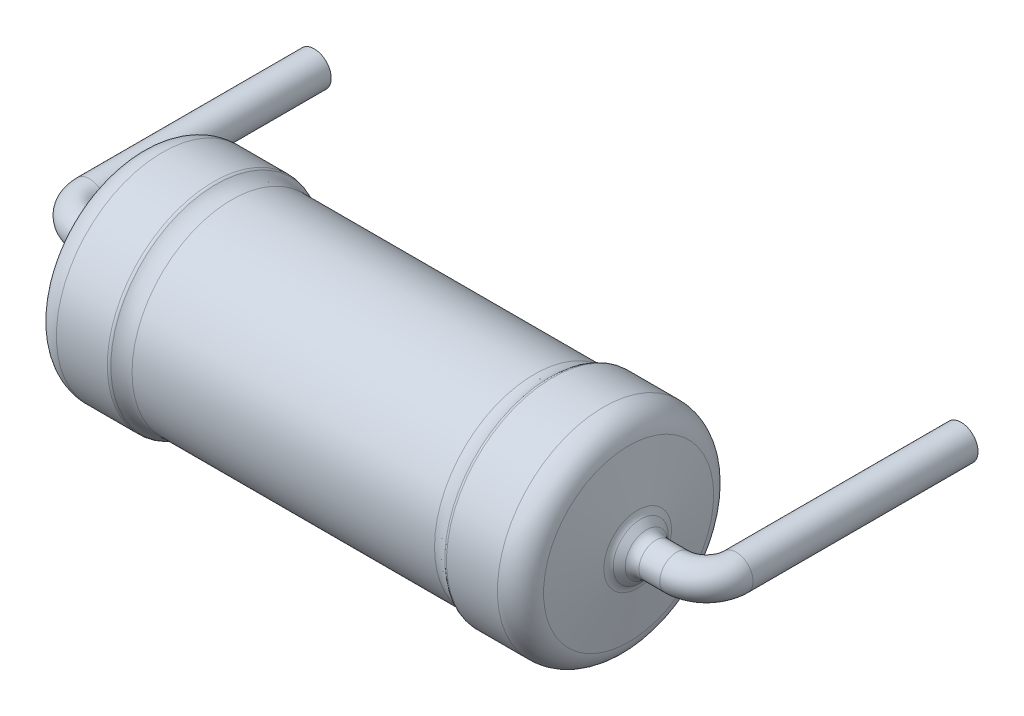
ISO-10303-21;
HEADER;
FILE_DESCRIPTION(('STEP AP214'),'2;1');
FILE_NAME('part.step','',(''),(''),'','','');
FILE_SCHEMA(('AUTOMOTIVE_DESIGN { 1 0 10303 214 1 1 1 1 }'));
ENDSEC;
DATA;
#1=APPLICATION_CONTEXT('core data for automotive mechanical design processes');
#2=APPLICATION_PROTOCOL_DEFINITION('international standard','automotive_design',2000,#1);
#3=PRODUCT_CONTEXT('',#1,'mechanical');
#4=PRODUCT('Part','Part','',(#3));
#5=PRODUCT_RELATED_PRODUCT_CATEGORY('part','',(#4));
#6=PRODUCT_DEFINITION_FORMATION('','',#4);
#7=PRODUCT_DEFINITION_CONTEXT('part definition',#1,'design');
#8=PRODUCT_DEFINITION('design','',#6,#7);
#9=PRODUCT_DEFINITION_SHAPE('','',#8);
#10=(LENGTH_UNIT() NAMED_UNIT(*) SI_UNIT(.MILLI.,.METRE.));
#11=(NAMED_UNIT(*) PLANE_ANGLE_UNIT() SI_UNIT($,.RADIAN.));
#12=(NAMED_UNIT(*) SI_UNIT($,.STERADIAN.) SOLID_ANGLE_UNIT());
#13=UNCERTAINTY_MEASURE_WITH_UNIT(LENGTH_MEASURE(1.E-05),#10,'distance_accuracy_value','');
#14=(GEOMETRIC_REPRESENTATION_CONTEXT(3) GLOBAL_UNCERTAINTY_ASSIGNED_CONTEXT((#13)) GLOBAL_UNIT_ASSIGNED_CONTEXT((#10,
#11,#12)) REPRESENTATION_CONTEXT('',''));
#15=CARTESIAN_POINT('',(0.,0.,0.));
#16=DIRECTION('',(0.,0.,1.));
#17=DIRECTION('',(1.,0.,0.));
#18=AXIS2_PLACEMENT_3D('',#15,#16,#17);
#19=CARTESIAN_POINT('',(1.1907315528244,0.,0.));
#20=DIRECTION('',(-1.,0.,0.));
#21=DIRECTION('',(0.,0.,1.));
#22=AXIS2_PLACEMENT_3D('',#19,#20,#21);
#23=PLANE('',#22);
#24=CARTESIAN_POINT('',(1.1907315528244,0.,3.5));
#25=DIRECTION('',(-1.,0.,0.));
#26=DIRECTION('',(0.,0.,1.));
#27=AXIS2_PLACEMENT_3D('',#24,#25,#26);
#28=CIRCLE('',#27,0.400000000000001);
#29=CARTESIAN_POINT('',(1.1907315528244,0.,3.9));
#30=VERTEX_POINT('',#29);
#31=EDGE_CURVE('P0_E18',#30,#30,#28,.T.);
#32=ORIENTED_EDGE('',*,*,#31,.F.);
#33=EDGE_LOOP('',(#32));
#34=FACE_BOUND('',#33,.T.);
#35=ADVANCED_FACE('P0_F15',(#34),#23,.F.);
#36=CARTESIAN_POINT('',(1.1907315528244,0.,3.5));
#37=DIRECTION('',(-1.,0.,0.));
#38=DIRECTION('',(0.,0.,1.));
#39=AXIS2_PLACEMENT_3D('',#36,#37,#38);
#40=CYLINDRICAL_SURFACE('',#39,0.400000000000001);
#41=CARTESIAN_POINT('',(0.700000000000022,0.,3.5));
#42=DIRECTION('',(-1.,0.,0.));
#43=DIRECTION('',(0.,0.,1.));
#44=AXIS2_PLACEMENT_3D('',#41,#42,#43);
#45=CIRCLE('',#44,0.400000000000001);
#46=CARTESIAN_POINT('',(0.700000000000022,0.,3.9));
#47=VERTEX_POINT('',#46);
#48=EDGE_CURVE('P0_E26',#47,#47,#45,.T.);
#49=ORIENTED_EDGE('',*,*,#48,.F.);
#50=EDGE_LOOP('',(#49));
#51=FACE_BOUND('',#50,.T.);
#52=ORIENTED_EDGE('',*,*,#31,.T.);
#53=EDGE_LOOP('',(#52));
#54=FACE_BOUND('',#53,.T.);
#55=ADVANCED_FACE('P0_F41',(#51,#54),#40,.T.);
#56=CARTESIAN_POINT('',(0.700000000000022,0.,2.79999999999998));
#57=DIRECTION('',(0.,-1.,0.));
#58=DIRECTION('',(0.,0.,1.));
#59=AXIS2_PLACEMENT_3D('',#56,#57,#58);
#60=TOROIDAL_SURFACE('',#59,0.700000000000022,0.400000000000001);
#61=CARTESIAN_POINT('',(0.,0.,2.79999999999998));
#62=DIRECTION('',(0.,0.,-1.));
#63=DIRECTION('',(-1.,0.,0.));
#64=AXIS2_PLACEMENT_3D('',#61,#62,#63);
#65=CIRCLE('',#64,0.400000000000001);
#66=CARTESIAN_POINT('',(-0.400000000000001,0.,2.79999999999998));
#67=VERTEX_POINT('',#66);
#68=EDGE_CURVE('P0_E22',#67,#67,#65,.T.);
#69=ORIENTED_EDGE('',*,*,#68,.F.);
#70=EDGE_LOOP('',(#69));
#71=FACE_BOUND('',#70,.T.);
#72=ORIENTED_EDGE('',*,*,#48,.T.);
#73=EDGE_LOOP('',(#72));
#74=FACE_BOUND('',#73,.T.);
#75=ADVANCED_FACE('P0_F37',(#71,#74),#60,.T.);
#76=CARTESIAN_POINT('',(3.5,0.,-2.5));
#77=DIRECTION('',(0.,0.,-1.));
#78=DIRECTION('',(-1.,0.,0.));
#79=AXIS2_PLACEMENT_3D('',#76,#77,#78);
#80=PLANE('',#79);
#81=CARTESIAN_POINT('',(0.,0.,-2.5));
#82=DIRECTION('',(0.,0.,-1.));
#83=DIRECTION('',(-1.,0.,0.));
#84=AXIS2_PLACEMENT_3D('',#81,#82,#83);
#85=CIRCLE('',#84,0.400000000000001);
#86=CARTESIAN_POINT('',(-0.400000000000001,0.,-2.5));
#87=VERTEX_POINT('',#86);
#88=EDGE_CURVE('P0_E10',#87,#87,#85,.F.);
#89=ORIENTED_EDGE('',*,*,#88,.F.);
#90=EDGE_LOOP('',(#89));
#91=FACE_BOUND('',#90,.T.);
#92=ADVANCED_FACE('P0_F40',(#91),#80,.T.);
#93=CARTESIAN_POINT('',(0.,0.,2.79999999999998));
#94=DIRECTION('',(0.,0.,-1.));
#95=DIRECTION('',(-1.,0.,0.));
#96=AXIS2_PLACEMENT_3D('',#93,#94,#95);
#97=CYLINDRICAL_SURFACE('',#96,0.400000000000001);
#98=ORIENTED_EDGE('',*,*,#88,.T.);
#99=EDGE_LOOP('',(#98));
#100=FACE_BOUND('',#99,.T.);
#101=ORIENTED_EDGE('',*,*,#68,.T.);
#102=EDGE_LOOP('',(#101));
#103=FACE_BOUND('',#102,.T.);
#104=ADVANCED_FACE('P0_F53',(#100,#103),#97,.T.);
#105=CLOSED_SHELL('',(#35,#55,#75,#92,#104));
#106=MANIFOLD_SOLID_BREP('P0_B1',#105);
#107=CARTESIAN_POINT('',(14.0492684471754,0.,0.));
#108=DIRECTION('',(1.,0.,0.));
#109=DIRECTION('',(0.,0.,-1.));
#110=AXIS2_PLACEMENT_3D('',#107,#108,#109);
#111=PLANE('',#110);
#112=CARTESIAN_POINT('',(14.0492684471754,0.,3.5));
#113=DIRECTION('',(1.,0.,0.));
#114=DIRECTION('',(0.,0.,-1.));
#115=AXIS2_PLACEMENT_3D('',#112,#113,#114);
#116=CIRCLE('',#115,0.4);
#117=CARTESIAN_POINT('',(14.0492684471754,0.,3.1));
#118=VERTEX_POINT('',#117);
#119=EDGE_CURVE('P1_E18',#118,#118,#116,.T.);
#120=ORIENTED_EDGE('',*,*,#119,.F.);
#121=EDGE_LOOP('',(#120));
#122=FACE_BOUND('',#121,.T.);
#123=ADVANCED_FACE('P1_F15',(#122),#111,.F.);
#124=CARTESIAN_POINT('',(14.0492684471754,0.,3.5));
#125=DIRECTION('',(1.,0.,0.));
#126=DIRECTION('',(0.,0.,-1.));
#127=AXIS2_PLACEMENT_3D('',#124,#125,#126);
#128=CYLINDRICAL_SURFACE('',#127,0.4);
#129=ORIENTED_EDGE('',*,*,#119,.T.);
#130=EDGE_LOOP('',(#129));
#131=FACE_BOUND('',#130,.T.);
#132=CARTESIAN_POINT('',(14.5399999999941,0.,3.5));
#133=DIRECTION('',(1.,0.,0.));
#134=DIRECTION('',(0.,0.,1.));
#135=AXIS2_PLACEMENT_3D('',#132,#133,#134);
#136=CIRCLE('',#135,0.4);
#137=CARTESIAN_POINT('',(14.5399999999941,0.,3.9));
#138=VERTEX_POINT('',#137);
#139=EDGE_CURVE('P1_E26',#138,#138,#136,.T.);
#140=ORIENTED_EDGE('',*,*,#139,.F.);
#141=EDGE_LOOP('',(#140));
#142=FACE_BOUND('',#141,.T.);
#143=ADVANCED_FACE('P1_F41',(#131,#142),#128,.T.);
#144=CARTESIAN_POINT('',(14.5399999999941,0.,2.80000000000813));
#145=DIRECTION('',(0.,1.,0.));
#146=DIRECTION('',(0.,0.,1.));
#147=AXIS2_PLACEMENT_3D('',#144,#145,#146);
#148=TOROIDAL_SURFACE('',#147,0.699999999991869,0.4);
#149=ORIENTED_EDGE('',*,*,#139,.T.);
#150=EDGE_LOOP('',(#149));
#151=FACE_BOUND('',#150,.T.);
#152=CARTESIAN_POINT('',(15.239999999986,0.,2.80000000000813));
#153=DIRECTION('',(8.45143661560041E-12,0.,-1.));
#154=DIRECTION('',(-1.,0.,-8.45143661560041E-12));
#155=AXIS2_PLACEMENT_3D('',#152,#153,#154);
#156=CIRCLE('',#155,0.4);
#157=CARTESIAN_POINT('',(14.839999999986,0.,2.80000000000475));
#158=VERTEX_POINT('',#157);
#159=EDGE_CURVE('P1_E22',#158,#158,#156,.T.);
#160=ORIENTED_EDGE('',*,*,#159,.F.);
#161=EDGE_LOOP('',(#160));
#162=FACE_BOUND('',#161,.T.);
#163=ADVANCED_FACE('P1_F37',(#151,#162),#148,.T.);
#164=CARTESIAN_POINT('',(11.7400000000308,0.,-2.49999999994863));
#165=DIRECTION('',(0.,0.,-1.));
#166=DIRECTION('',(-1.,0.,0.));
#167=AXIS2_PLACEMENT_3D('',#164,#165,#166);
#168=PLANE('',#167);
#169=CARTESIAN_POINT('',(15.2400000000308,0.,-2.49999999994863));
#170=DIRECTION('',(8.45143661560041E-12,0.,-1.));
#171=DIRECTION('',(-1.,0.,-8.45143661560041E-12));
#172=AXIS2_PLACEMENT_3D('',#169,#170,#171);
#173=CIRCLE('',#172,0.4);
#174=CARTESIAN_POINT('',(14.8400000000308,0.,-2.49999999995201));
#175=VERTEX_POINT('',#174);
#176=EDGE_CURVE('P1_E10',#175,#175,#173,.F.);
#177=ORIENTED_EDGE('',*,*,#176,.F.);
#178=EDGE_LOOP('',(#177));
#179=FACE_BOUND('',#178,.T.);
#180=ADVANCED_FACE('P1_F40',(#179),#168,.T.);
#181=CARTESIAN_POINT('',(15.239999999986,0.,2.80000000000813));
#182=DIRECTION('',(8.45143661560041E-12,0.,-1.));
#183=DIRECTION('',(-1.,0.,-8.45143661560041E-12));
#184=AXIS2_PLACEMENT_3D('',#181,#182,#183);
#185=CYLINDRICAL_SURFACE('',#184,0.4);
#186=ORIENTED_EDGE('',*,*,#176,.T.);
#187=EDGE_LOOP('',(#186));
#188=FACE_BOUND('',#187,.T.);
#189=ORIENTED_EDGE('',*,*,#159,.T.);
#190=EDGE_LOOP('',(#189));
#191=FACE_BOUND('',#190,.T.);
#192=ADVANCED_FACE('P1_F53',(#188,#191),#185,.T.);
#193=CLOSED_SHELL('',(#123,#143,#163,#180,#192));
#194=MANIFOLD_SOLID_BREP('P1_B1',#193);
#195=CARTESIAN_POINT('',(1.1907315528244,0.,3.5));
#196=DIRECTION('',(-1.,0.,0.));
#197=DIRECTION('',(0.,0.,1.));
#198=AXIS2_PLACEMENT_3D('',#195,#196,#197);
#199=PLANE('',#198);
#200=CARTESIAN_POINT('',(1.1907315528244,0.,3.5));
#201=DIRECTION('',(1.,0.,0.));
#202=DIRECTION('',(0.,0.,-1.));
#203=AXIS2_PLACEMENT_3D('',#200,#201,#202);
#204=CIRCLE('',#203,0.400000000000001);
#205=CARTESIAN_POINT('',(1.1907315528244,0.,3.1));
#206=VERTEX_POINT('',#205);
#207=EDGE_CURVE('P2_E17',#206,#206,#204,.F.);
#208=ORIENTED_EDGE('',*,*,#207,.T.);
#209=EDGE_LOOP('',(#208));
#210=FACE_BOUND('',#209,.T.);
#211=ADVANCED_FACE('P2_F14',(#210),#199,.T.);
#212=CARTESIAN_POINT('',(1.1907315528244,0.,3.5));
#213=DIRECTION('',(1.,0.,0.));
#214=DIRECTION('',(0.,0.,-1.));
#215=AXIS2_PLACEMENT_3D('',#212,#213,#214);
#216=TOROIDAL_SURFACE('',#215,0.700000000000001,0.3);
#217=ORIENTED_EDGE('',*,*,#207,.F.);
#218=EDGE_LOOP('',(#217));
#219=FACE_BOUND('',#218,.T.);
#220=CARTESIAN_POINT('',(1.41367500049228,0.,3.5));
#221=DIRECTION('',(1.,0.,0.));
#222=DIRECTION('',(0.,0.,-1.));
#223=AXIS2_PLACEMENT_3D('',#220,#221,#222);
#224=CIRCLE('',#223,0.499260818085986);
#225=CARTESIAN_POINT('',(1.41367500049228,0.,3.00073918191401));
#226=VERTEX_POINT('',#225);
#227=EDGE_CURVE('P2_E321',#226,#226,#224,.T.);
#228=ORIENTED_EDGE('',*,*,#227,.F.);
#229=EDGE_LOOP('',(#228));
#230=FACE_BOUND('',#229,.T.);
#231=ADVANCED_FACE('P2_F163',(#219,#230),#216,.F.);
#232=CARTESIAN_POINT('',(1.54750112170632,0.,3.5));
#233=DIRECTION('',(1.,0.,0.));
#234=DIRECTION('',(0.,0.,-1.));
#235=AXIS2_PLACEMENT_3D('',#232,#233,#234);
#236=CONICAL_SURFACE('',#235,0.647889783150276,0.837758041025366);
#237=ORIENTED_EDGE('',*,*,#227,.T.);
#238=EDGE_LOOP('',(#237));
#239=FACE_BOUND('',#238,.T.);
#240=CARTESIAN_POINT('',(1.54750112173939,0.,3.5));
#241=DIRECTION('',(1.,0.,0.));
#242=DIRECTION('',(0.,0.,-1.));
#243=AXIS2_PLACEMENT_3D('',#240,#241,#242);
#244=CIRCLE('',#243,0.647889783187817);
#245=CARTESIAN_POINT('',(1.54750112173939,0.,2.85211021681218));
#246=VERTEX_POINT('',#245);
#247=EDGE_CURVE('P2_E149',#246,#246,#244,.F.);
#248=ORIENTED_EDGE('',*,*,#247,.T.);
#249=EDGE_LOOP('',(#248));
#250=FACE_BOUND('',#249,.T.);
#251=ADVANCED_FACE('P2_F160',(#239,#250),#236,.T.);
#252=CARTESIAN_POINT('',(1.32455767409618,0.,3.5));
#253=DIRECTION('',(1.,0.,0.));
#254=DIRECTION('',(0.,0.,-1.));
#255=AXIS2_PLACEMENT_3D('',#252,#253,#254);
#256=TOROIDAL_SURFACE('',#255,0.848628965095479,0.3);
#257=ORIENTED_EDGE('',*,*,#247,.F.);
#258=EDGE_LOOP('',(#257));
#259=FACE_BOUND('',#258,.T.);
#260=CARTESIAN_POINT('',(1.62000000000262,0.,3.5));
#261=DIRECTION('',(1.,0.,0.));
#262=DIRECTION('',(0.,0.,-1.));
#263=AXIS2_PLACEMENT_3D('',#260,#261,#262);
#264=CIRCLE('',#263,0.796534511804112);
#265=CARTESIAN_POINT('',(1.62000000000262,0.,2.70346548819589));
#266=VERTEX_POINT('',#265);
#267=EDGE_CURVE('P2_E145',#266,#266,#264,.T.);
#268=ORIENTED_EDGE('',*,*,#267,.F.);
#269=EDGE_LOOP('',(#268));
#270=FACE_BOUND('',#269,.T.);
#271=ADVANCED_FACE('P2_F156',(#259,#270),#256,.F.);
#272=CARTESIAN_POINT('',(14.0492684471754,0.,3.5));
#273=DIRECTION('',(1.,0.,0.));
#274=DIRECTION('',(0.,0.,-1.));
#275=AXIS2_PLACEMENT_3D('',#272,#273,#274);
#276=PLANE('',#275);
#277=CARTESIAN_POINT('',(14.0492684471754,0.,3.5));
#278=DIRECTION('',(1.,0.,0.));
#279=DIRECTION('',(0.,0.,-1.));
#280=AXIS2_PLACEMENT_3D('',#277,#278,#279);
#281=CIRCLE('',#280,0.4);
#282=CARTESIAN_POINT('',(14.0492684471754,0.,3.1));
#283=VERTEX_POINT('',#282);
#284=EDGE_CURVE('P2_E148',#283,#283,#281,.T.);
#285=ORIENTED_EDGE('',*,*,#284,.T.);
#286=EDGE_LOOP('',(#285));
#287=FACE_BOUND('',#286,.T.);
#288=ADVANCED_FACE('P2_F159',(#287),#276,.T.);
#289=CARTESIAN_POINT('',(1.83294205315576,0.,3.5));
#290=DIRECTION('',(1.,0.,0.));
#291=DIRECTION('',(0.,0.,-1.));
#292=AXIS2_PLACEMENT_3D('',#289,#290,#291);
#293=CONICAL_SURFACE('',#292,2.00418890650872,1.39626340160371);
#294=ORIENTED_EDGE('',*,*,#267,.T.);
#295=EDGE_LOOP('',(#294));
#296=FACE_BOUND('',#295,.T.);
#297=CARTESIAN_POINT('',(1.83294205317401,0.,3.5));
#298=DIRECTION('',(1.,0.,0.));
#299=DIRECTION('',(0.,0.,-1.));
#300=AXIS2_PLACEMENT_3D('',#297,#298,#299);
#301=CIRCLE('',#300,2.00418890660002);
#302=CARTESIAN_POINT('',(1.83294205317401,0.,1.49581109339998));
#303=VERTEX_POINT('',#302);
#304=EDGE_CURVE('P2_E123',#303,#303,#301,.T.);
#305=ORIENTED_EDGE('',*,*,#304,.F.);
#306=EDGE_LOOP('',(#305));
#307=FACE_BOUND('',#306,.T.);
#308=ADVANCED_FACE('P2_F139',(#296,#307),#293,.T.);
#309=CARTESIAN_POINT('',(14.0492684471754,0.,3.5));
#310=DIRECTION('',(1.,0.,0.));
#311=DIRECTION('',(0.,0.,-1.));
#312=AXIS2_PLACEMENT_3D('',#309,#310,#311);
#313=TOROIDAL_SURFACE('',#312,0.7,0.3);
#314=CARTESIAN_POINT('',(13.8263249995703,0.,3.5));
#315=DIRECTION('',(-1.,0.,0.));
#316=DIRECTION('',(0.,0.,1.));
#317=AXIS2_PLACEMENT_3D('',#314,#315,#316);
#318=CIRCLE('',#317,0.499260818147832);
#319=CARTESIAN_POINT('',(13.8263249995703,0.,3.99926081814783));
#320=VERTEX_POINT('',#319);
#321=EDGE_CURVE('P2_E118',#320,#320,#318,.T.);
#322=ORIENTED_EDGE('',*,*,#321,.F.);
#323=EDGE_LOOP('',(#322));
#324=FACE_BOUND('',#323,.T.);
#325=ORIENTED_EDGE('',*,*,#284,.F.);
#326=EDGE_LOOP('',(#325));
#327=FACE_BOUND('',#326,.T.);
#328=ADVANCED_FACE('P2_F134',(#324,#327),#313,.F.);
#329=CARTESIAN_POINT('',(2.42382670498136,0.,3.5));
#330=DIRECTION('',(1.,0.,0.));
#331=DIRECTION('',(0.,0.,-1.));
#332=AXIS2_PLACEMENT_3D('',#329,#330,#331);
#333=TOROIDAL_SURFACE('',#332,1.9,0.600000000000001);
#334=ORIENTED_EDGE('',*,*,#304,.T.);
#335=EDGE_LOOP('',(#334));
#336=FACE_BOUND('',#335,.T.);
#337=CARTESIAN_POINT('',(2.42382670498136,0.,3.5));
#338=DIRECTION('',(1.,0.,0.));
#339=DIRECTION('',(0.,0.,-1.));
#340=AXIS2_PLACEMENT_3D('',#337,#338,#339);
#341=CIRCLE('',#340,2.5);
#342=CARTESIAN_POINT('',(2.42382670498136,0.,1.));
#343=VERTEX_POINT('',#342);
#344=EDGE_CURVE('P2_E113',#343,#343,#341,.T.);
#345=ORIENTED_EDGE('',*,*,#344,.F.);
#346=EDGE_LOOP('',(#345));
#347=FACE_BOUND('',#346,.T.);
#348=ADVANCED_FACE('P2_F130',(#336,#347),#333,.T.);
#349=CARTESIAN_POINT('',(13.6924988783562,0.,3.5));
#350=DIRECTION('',(-1.,0.,0.));
#351=DIRECTION('',(0.,0.,1.));
#352=AXIS2_PLACEMENT_3D('',#349,#350,#351);
#353=CONICAL_SURFACE('',#352,0.647889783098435,0.837758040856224);
#354=CARTESIAN_POINT('',(13.6924988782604,0.,3.5));
#355=DIRECTION('',(1.,0.,0.));
#356=DIRECTION('',(0.,0.,-1.));
#357=AXIS2_PLACEMENT_3D('',#354,#355,#356);
#358=CIRCLE('',#357,0.647889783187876);
#359=CARTESIAN_POINT('',(13.6924988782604,0.,2.85211021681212));
#360=VERTEX_POINT('',#359);
#361=EDGE_CURVE('P2_E110',#360,#360,#358,.T.);
#362=ORIENTED_EDGE('',*,*,#361,.T.);
#363=EDGE_LOOP('',(#362));
#364=FACE_BOUND('',#363,.T.);
#365=ORIENTED_EDGE('',*,*,#321,.T.);
#366=EDGE_LOOP('',(#365));
#367=FACE_BOUND('',#366,.T.);
#368=ADVANCED_FACE('P2_F133',(#364,#367),#353,.T.);
#369=CARTESIAN_POINT('',(2.42382670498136,0.,3.5));
#370=DIRECTION('',(1.,0.,0.));
#371=DIRECTION('',(0.,0.,-1.));
#372=AXIS2_PLACEMENT_3D('',#369,#370,#371);
#373=CYLINDRICAL_SURFACE('',#372,2.5);
#374=ORIENTED_EDGE('',*,*,#344,.T.);
#375=EDGE_LOOP('',(#374));
#376=FACE_BOUND('',#375,.T.);
#377=CARTESIAN_POINT('',(3.62382670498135,0.,3.5));
#378=DIRECTION('',(1.,0.,0.));
#379=DIRECTION('',(0.,0.,-1.));
#380=AXIS2_PLACEMENT_3D('',#377,#378,#379);
#381=CIRCLE('',#380,2.5);
#382=CARTESIAN_POINT('',(3.62382670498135,0.,1.));
#383=VERTEX_POINT('',#382);
#384=EDGE_CURVE('P2_E90',#383,#383,#381,.T.);
#385=ORIENTED_EDGE('',*,*,#384,.F.);
#386=EDGE_LOOP('',(#385));
#387=FACE_BOUND('',#386,.T.);
#388=ADVANCED_FACE('P2_F104',(#376,#387),#373,.T.);
#389=CARTESIAN_POINT('',(13.9154423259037,0.,3.5));
#390=DIRECTION('',(1.,0.,0.));
#391=DIRECTION('',(0.,0.,-1.));
#392=AXIS2_PLACEMENT_3D('',#389,#390,#391);
#393=TOROIDAL_SURFACE('',#392,0.848628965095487,0.3);
#394=CARTESIAN_POINT('',(13.6200000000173,0.,3.5));
#395=DIRECTION('',(-1.,0.,0.));
#396=DIRECTION('',(0.,0.,1.));
#397=AXIS2_PLACEMENT_3D('',#394,#395,#396);
#398=CIRCLE('',#397,0.796534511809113);
#399=CARTESIAN_POINT('',(13.6200000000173,0.,4.29653451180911));
#400=VERTEX_POINT('',#399);
#401=EDGE_CURVE('P2_E85',#400,#400,#398,.T.);
#402=ORIENTED_EDGE('',*,*,#401,.F.);
#403=EDGE_LOOP('',(#402));
#404=FACE_BOUND('',#403,.T.);
#405=ORIENTED_EDGE('',*,*,#361,.F.);
#406=EDGE_LOOP('',(#405));
#407=FACE_BOUND('',#406,.T.);
#408=ADVANCED_FACE('P2_F99',(#404,#407),#393,.F.);
#409=CARTESIAN_POINT('',(3.62382670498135,0.,3.5));
#410=DIRECTION('',(1.,0.,0.));
#411=DIRECTION('',(0.,0.,-1.));
#412=AXIS2_PLACEMENT_3D('',#409,#410,#411);
#413=TOROIDAL_SURFACE('',#412,2.4,0.1);
#414=ORIENTED_EDGE('',*,*,#384,.T.);
#415=EDGE_LOOP('',(#414));
#416=FACE_BOUND('',#415,.T.);
#417=CARTESIAN_POINT('',(3.68568566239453,0.,3.5));
#418=DIRECTION('',(1.,0.,0.));
#419=DIRECTION('',(0.,0.,-1.));
#420=AXIS2_PLACEMENT_3D('',#417,#418,#419);
#421=CIRCLE('',#420,2.47857142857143);
#422=CARTESIAN_POINT('',(3.68568566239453,0.,1.02142857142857));
#423=VERTEX_POINT('',#422);
#424=EDGE_CURVE('P2_E82',#423,#423,#421,.F.);
#425=ORIENTED_EDGE('',*,*,#424,.T.);
#426=EDGE_LOOP('',(#425));
#427=FACE_BOUND('',#426,.T.);
#428=ADVANCED_FACE('P2_F96',(#416,#427),#413,.T.);
#429=CARTESIAN_POINT('',(13.4070579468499,0.,3.5));
#430=DIRECTION('',(-1.,0.,0.));
#431=DIRECTION('',(0.,-1.,0.));
#432=AXIS2_PLACEMENT_3D('',#429,#430,#431);
#433=CONICAL_SURFACE('',#432,2.00418890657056,1.39626340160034);
#434=CARTESIAN_POINT('',(13.4070579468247,0.,3.5));
#435=DIRECTION('',(1.,0.,0.));
#436=DIRECTION('',(0.,0.,-1.));
#437=AXIS2_PLACEMENT_3D('',#434,#435,#436);
#438=CIRCLE('',#437,2.00418890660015);
#439=CARTESIAN_POINT('',(13.4070579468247,0.,1.49581109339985));
#440=VERTEX_POINT('',#439);
#441=EDGE_CURVE('P2_E62',#440,#440,#438,.F.);
#442=ORIENTED_EDGE('',*,*,#441,.F.);
#443=EDGE_LOOP('',(#442));
#444=FACE_BOUND('',#443,.T.);
#445=ORIENTED_EDGE('',*,*,#401,.T.);
#446=EDGE_LOOP('',(#445));
#447=FACE_BOUND('',#446,.T.);
#448=ADVANCED_FACE('P2_F76',(#444,#447),#433,.T.);
#449=CARTESIAN_POINT('',(4.05683940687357,0.,3.5));
#450=DIRECTION('',(1.,0.,0.));
#451=DIRECTION('',(0.,0.,-1.));
#452=AXIS2_PLACEMENT_3D('',#449,#450,#451);
#453=TOROIDAL_SURFACE('',#452,2.95,0.600000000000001);
#454=ORIENTED_EDGE('',*,*,#424,.F.);
#455=EDGE_LOOP('',(#454));
#456=FACE_BOUND('',#455,.T.);
#457=CARTESIAN_POINT('',(4.05683940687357,0.,3.5));
#458=DIRECTION('',(1.,0.,0.));
#459=DIRECTION('',(0.,0.,-1.));
#460=AXIS2_PLACEMENT_3D('',#457,#458,#459);
#461=CIRCLE('',#460,2.35);
#462=CARTESIAN_POINT('',(4.05683940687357,0.,1.15));
#463=VERTEX_POINT('',#462);
#464=EDGE_CURVE('P2_E57',#463,#463,#461,.T.);
#465=ORIENTED_EDGE('',*,*,#464,.F.);
#466=EDGE_LOOP('',(#465));
#467=FACE_BOUND('',#466,.T.);
#468=ADVANCED_FACE('P2_F71',(#456,#467),#453,.F.);
#469=CARTESIAN_POINT('',(12.8161732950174,0.,3.5));
#470=DIRECTION('',(1.,0.,0.));
#471=DIRECTION('',(0.,0.,-1.));
#472=AXIS2_PLACEMENT_3D('',#469,#470,#471);
#473=TOROIDAL_SURFACE('',#472,1.9,0.600000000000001);
#474=CARTESIAN_POINT('',(12.8161732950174,0.,3.5));
#475=DIRECTION('',(1.,0.,0.));
#476=DIRECTION('',(0.,0.,-1.));
#477=AXIS2_PLACEMENT_3D('',#474,#475,#476);
#478=CIRCLE('',#477,2.5);
#479=CARTESIAN_POINT('',(12.8161732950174,0.,1.));
#480=VERTEX_POINT('',#479);
#481=EDGE_CURVE('P2_E52',#480,#480,#478,.F.);
#482=ORIENTED_EDGE('',*,*,#481,.F.);
#483=EDGE_LOOP('',(#482));
#484=FACE_BOUND('',#483,.T.);
#485=ORIENTED_EDGE('',*,*,#441,.T.);
#486=EDGE_LOOP('',(#485));
#487=FACE_BOUND('',#486,.T.);
#488=ADVANCED_FACE('P2_F68',(#484,#487),#473,.T.);
#489=CARTESIAN_POINT('',(11.6161732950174,0.,3.5));
#490=DIRECTION('',(1.,0.,0.));
#491=DIRECTION('',(0.,0.,-1.));
#492=AXIS2_PLACEMENT_3D('',#489,#490,#491);
#493=CYLINDRICAL_SURFACE('',#492,2.5);
#494=CARTESIAN_POINT('',(11.6161732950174,0.,3.5));
#495=DIRECTION('',(1.,0.,0.));
#496=DIRECTION('',(0.,0.,-1.));
#497=AXIS2_PLACEMENT_3D('',#494,#495,#496);
#498=CIRCLE('',#497,2.5);
#499=CARTESIAN_POINT('',(11.6161732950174,0.,1.));
#500=VERTEX_POINT('',#499);
#501=EDGE_CURVE('P2_E26',#500,#500,#498,.F.);
#502=ORIENTED_EDGE('',*,*,#501,.F.);
#503=EDGE_LOOP('',(#502));
#504=FACE_BOUND('',#503,.T.);
#505=ORIENTED_EDGE('',*,*,#481,.T.);
#506=EDGE_LOOP('',(#505));
#507=FACE_BOUND('',#506,.T.);
#508=ADVANCED_FACE('P2_F44',(#504,#507),#493,.T.);
#509=CARTESIAN_POINT('',(11.6161732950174,0.,3.5));
#510=DIRECTION('',(1.,0.,0.));
#511=DIRECTION('',(0.,0.,-1.));
#512=AXIS2_PLACEMENT_3D('',#509,#510,#511);
#513=TOROIDAL_SURFACE('',#512,2.4,0.1);
#514=CARTESIAN_POINT('',(11.5543143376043,0.,3.5));
#515=DIRECTION('',(1.,0.,0.));
#516=DIRECTION('',(0.,0.,-1.));
#517=AXIS2_PLACEMENT_3D('',#514,#515,#516);
#518=CIRCLE('',#517,2.47857142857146);
#519=CARTESIAN_POINT('',(11.5543143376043,0.,1.02142857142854));
#520=VERTEX_POINT('',#519);
#521=EDGE_CURVE('P2_E21',#520,#520,#518,.T.);
#522=ORIENTED_EDGE('',*,*,#521,.T.);
#523=EDGE_LOOP('',(#522));
#524=FACE_BOUND('',#523,.T.);
#525=ORIENTED_EDGE('',*,*,#501,.T.);
#526=EDGE_LOOP('',(#525));
#527=FACE_BOUND('',#526,.T.);
#528=ADVANCED_FACE('P2_F39',(#524,#527),#513,.T.);
#529=CARTESIAN_POINT('',(11.1831605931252,0.,3.5));
#530=DIRECTION('',(1.,0.,0.));
#531=DIRECTION('',(0.,0.,-1.));
#532=AXIS2_PLACEMENT_3D('',#529,#530,#531);
#533=TOROIDAL_SURFACE('',#532,2.95,0.600000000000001);
#534=CARTESIAN_POINT('',(11.1831605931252,0.,3.5));
#535=DIRECTION('',(1.,0.,0.));
#536=DIRECTION('',(0.,0.,-1.));
#537=AXIS2_PLACEMENT_3D('',#534,#535,#536);
#538=CIRCLE('',#537,2.35);
#539=CARTESIAN_POINT('',(11.1831605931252,0.,1.15));
#540=VERTEX_POINT('',#539);
#541=EDGE_CURVE('P2_E9',#540,#540,#538,.F.);
#542=ORIENTED_EDGE('',*,*,#541,.F.);
#543=EDGE_LOOP('',(#542));
#544=FACE_BOUND('',#543,.T.);
#545=ORIENTED_EDGE('',*,*,#521,.F.);
#546=EDGE_LOOP('',(#545));
#547=FACE_BOUND('',#546,.T.);
#548=ADVANCED_FACE('P2_F34',(#544,#547),#533,.F.);
#549=CARTESIAN_POINT('',(4.05683940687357,0.,3.5));
#550=DIRECTION('',(1.,0.,0.));
#551=DIRECTION('',(0.,0.,-1.));
#552=AXIS2_PLACEMENT_3D('',#549,#550,#551);
#553=CYLINDRICAL_SURFACE('',#552,2.35);
#554=ORIENTED_EDGE('',*,*,#541,.T.);
#555=EDGE_LOOP('',(#554));
#556=FACE_BOUND('',#555,.T.);
#557=ORIENTED_EDGE('',*,*,#464,.T.);
#558=EDGE_LOOP('',(#557));
#559=FACE_BOUND('',#558,.T.);
#560=ADVANCED_FACE('P2_F38',(#556,#559),#553,.T.);
#561=CLOSED_SHELL('',(#211,#231,#251,#271,#288,#308,#328,#348,#368,#388,#408,#428,#448,#468,
#488,#508,#528,#548,#560));
#562=MANIFOLD_SOLID_BREP('P2_B1',#561);
#563=ADVANCED_BREP_SHAPE_REPRESENTATION('',(#18,#106,#194,#562),#14);
#564=SHAPE_DEFINITION_REPRESENTATION(#9,#563);
ENDSEC;
END-ISO-10303-21;
